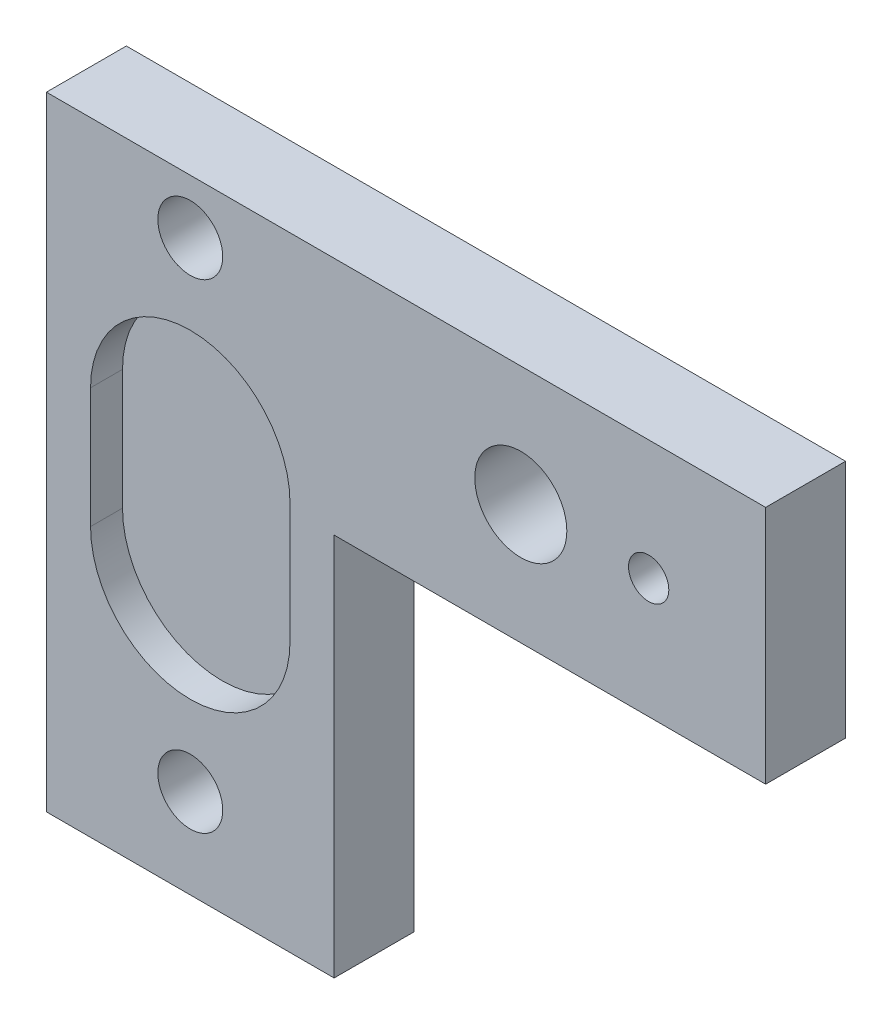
ISO-10303-21;
HEADER;
FILE_DESCRIPTION(('STEP AP214'),'2;1');
FILE_NAME('part.step','',(''),(''),'','','');
FILE_SCHEMA(('AUTOMOTIVE_DESIGN { 1 0 10303 214 1 1 1 1 }'));
ENDSEC;
DATA;
#1=APPLICATION_CONTEXT('core data for automotive mechanical design processes');
#2=APPLICATION_PROTOCOL_DEFINITION('international standard','automotive_design',2000,#1);
#3=PRODUCT_CONTEXT('',#1,'mechanical');
#4=PRODUCT('Part','Part','',(#3));
#5=PRODUCT_RELATED_PRODUCT_CATEGORY('part','',(#4));
#6=PRODUCT_DEFINITION_FORMATION('','',#4);
#7=PRODUCT_DEFINITION_CONTEXT('part definition',#1,'design');
#8=PRODUCT_DEFINITION('design','',#6,#7);
#9=PRODUCT_DEFINITION_SHAPE('','',#8);
#10=(LENGTH_UNIT() NAMED_UNIT(*) SI_UNIT(.MILLI.,.METRE.));
#11=(NAMED_UNIT(*) PLANE_ANGLE_UNIT() SI_UNIT($,.RADIAN.));
#12=(NAMED_UNIT(*) SI_UNIT($,.STERADIAN.) SOLID_ANGLE_UNIT());
#13=UNCERTAINTY_MEASURE_WITH_UNIT(LENGTH_MEASURE(1.E-05),#10,'distance_accuracy_value','');
#14=(GEOMETRIC_REPRESENTATION_CONTEXT(3) GLOBAL_UNCERTAINTY_ASSIGNED_CONTEXT((#13)) GLOBAL_UNIT_ASSIGNED_CONTEXT((#10,
#11,#12)) REPRESENTATION_CONTEXT('',''));
#15=CARTESIAN_POINT('',(0.,0.,0.));
#16=DIRECTION('',(0.,0.,1.));
#17=DIRECTION('',(1.,0.,0.));
#18=AXIS2_PLACEMENT_3D('',#15,#16,#17);
#19=CARTESIAN_POINT('',(0.,0.,3.17500000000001));
#20=DIRECTION('',(0.,0.,-1.));
#21=DIRECTION('',(-1.,0.,0.));
#22=AXIS2_PLACEMENT_3D('',#19,#20,#21);
#23=PLANE('',#22);
#24=DIRECTION('',(0.,-1.,0.));
#25=VECTOR('',#24,1.);
#26=CARTESIAN_POINT('',(1.75259999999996,-9.2964,3.175));
#27=LINE('',#26,#25);
#28=CARTESIAN_POINT('',(1.75259999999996,-9.2964,3.175));
#29=VERTEX_POINT('',#28);
#30=CARTESIAN_POINT('',(1.7526,-14.0716,3.17499999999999));
#31=VERTEX_POINT('',#30);
#32=EDGE_CURVE('E263',#29,#31,#27,.T.);
#33=ORIENTED_EDGE('',*,*,#32,.F.);
#34=CARTESIAN_POINT('',(5.71499999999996,-9.29639999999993,3.175));
#35=DIRECTION('',(0.,0.,1.));
#36=DIRECTION('',(1.,0.,0.));
#37=AXIS2_PLACEMENT_3D('',#34,#35,#36);
#38=CIRCLE('',#37,3.9624);
#39=CARTESIAN_POINT('',(9.67739999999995,-9.29639999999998,3.17499999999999));
#40=VERTEX_POINT('',#39);
#41=EDGE_CURVE('E61',#40,#29,#38,.T.);
#42=ORIENTED_EDGE('',*,*,#41,.F.);
#43=DIRECTION('',(0.,1.,0.));
#44=VECTOR('',#43,1.);
#45=CARTESIAN_POINT('',(9.67739999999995,-9.29639999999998,3.17499999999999));
#46=LINE('',#45,#44);
#47=CARTESIAN_POINT('',(9.6774,-14.0716,3.17499999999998));
#48=VERTEX_POINT('',#47);
#49=EDGE_CURVE('E236',#48,#40,#46,.T.);
#50=ORIENTED_EDGE('',*,*,#49,.F.);
#51=CARTESIAN_POINT('',(5.715,-14.0715999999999,3.175));
#52=DIRECTION('',(0.,0.,1.));
#53=DIRECTION('',(1.,0.,0.));
#54=AXIS2_PLACEMENT_3D('',#51,#52,#53);
#55=CIRCLE('',#54,3.9624);
#56=EDGE_CURVE('E264',#31,#48,#55,.T.);
#57=ORIENTED_EDGE('',*,*,#56,.F.);
#58=EDGE_LOOP('',(#33,#42,#50,#57));
#59=FACE_BOUND('',#58,.T.);
#60=CARTESIAN_POINT('',(18.8468,-4.7625,3.17499999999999));
#61=DIRECTION('',(0.,0.,1.));
#62=DIRECTION('',(1.,0.,0.));
#63=AXIS2_PLACEMENT_3D('',#60,#61,#62);
#64=CIRCLE('',#63,1.8288);
#65=CARTESIAN_POINT('',(20.6756,-4.7625,3.17499999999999));
#66=VERTEX_POINT('',#65);
#67=EDGE_CURVE('E205',#66,#66,#64,.T.);
#68=ORIENTED_EDGE('',*,*,#67,.F.);
#69=EDGE_LOOP('',(#68));
#70=FACE_BOUND('',#69,.T.);
#71=CARTESIAN_POINT('',(5.715,-2.15899999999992,3.175));
#72=DIRECTION('',(0.,0.,1.));
#73=DIRECTION('',(1.,0.,0.));
#74=AXIS2_PLACEMENT_3D('',#71,#72,#73);
#75=CIRCLE('',#74,1.28905);
#76=CARTESIAN_POINT('',(7.00405,-2.15899999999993,3.175));
#77=VERTEX_POINT('',#76);
#78=EDGE_CURVE('E190',#77,#77,#75,.T.);
#79=ORIENTED_EDGE('',*,*,#78,.F.);
#80=EDGE_LOOP('',(#79));
#81=FACE_BOUND('',#80,.T.);
#82=CARTESIAN_POINT('',(5.715,-21.2089999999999,3.17499999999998));
#83=DIRECTION('',(0.,0.,1.));
#84=DIRECTION('',(1.,0.,0.));
#85=AXIS2_PLACEMENT_3D('',#82,#83,#84);
#86=CIRCLE('',#85,1.28905);
#87=CARTESIAN_POINT('',(7.00405,-21.2089999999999,3.17499999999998));
#88=VERTEX_POINT('',#87);
#89=EDGE_CURVE('E186',#88,#88,#86,.T.);
#90=ORIENTED_EDGE('',*,*,#89,.F.);
#91=EDGE_LOOP('',(#90));
#92=FACE_BOUND('',#91,.T.);
#93=DIRECTION('',(0.,-1.,0.));
#94=VECTOR('',#93,1.);
#95=CARTESIAN_POINT('',(0.,-24.765,3.17499999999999));
#96=LINE('',#95,#94);
#97=CARTESIAN_POINT('',(0.,0.,3.17500000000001));
#98=VERTEX_POINT('',#97);
#99=CARTESIAN_POINT('',(0.,-24.765,3.17499999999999));
#100=VERTEX_POINT('',#99);
#101=EDGE_CURVE('E173',#98,#100,#96,.T.);
#102=ORIENTED_EDGE('',*,*,#101,.T.);
#103=DIRECTION('',(1.,0.,0.));
#104=VECTOR('',#103,1.);
#105=CARTESIAN_POINT('',(11.43,-24.765,3.17499999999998));
#106=LINE('',#105,#104);
#107=CARTESIAN_POINT('',(11.43,-24.765,3.17499999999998));
#108=VERTEX_POINT('',#107);
#109=EDGE_CURVE('E110',#100,#108,#106,.T.);
#110=ORIENTED_EDGE('',*,*,#109,.T.);
#111=DIRECTION('',(0.,1.,0.));
#112=VECTOR('',#111,1.);
#113=CARTESIAN_POINT('',(11.43,-9.52499999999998,3.17499999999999));
#114=LINE('',#113,#112);
#115=CARTESIAN_POINT('',(11.43,-9.52499999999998,3.17499999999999));
#116=VERTEX_POINT('',#115);
#117=EDGE_CURVE('E130',#108,#116,#114,.T.);
#118=ORIENTED_EDGE('',*,*,#117,.T.);
#119=DIRECTION('',(1.,0.,0.));
#120=VECTOR('',#119,1.);
#121=CARTESIAN_POINT('',(28.575,-9.52499999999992,3.17499999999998));
#122=LINE('',#121,#120);
#123=CARTESIAN_POINT('',(28.575,-9.52499999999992,3.17499999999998));
#124=VERTEX_POINT('',#123);
#125=EDGE_CURVE('E123',#116,#124,#122,.T.);
#126=ORIENTED_EDGE('',*,*,#125,.T.);
#127=DIRECTION('',(0.,1.,0.));
#128=VECTOR('',#127,1.);
#129=CARTESIAN_POINT('',(28.575,0.,3.17499999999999));
#130=LINE('',#129,#128);
#131=CARTESIAN_POINT('',(28.575,0.,3.17499999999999));
#132=VERTEX_POINT('',#131);
#133=EDGE_CURVE('E127',#124,#132,#130,.T.);
#134=ORIENTED_EDGE('',*,*,#133,.T.);
#135=DIRECTION('',(-1.,0.,0.));
#136=VECTOR('',#135,1.);
#137=CARTESIAN_POINT('',(0.,0.,3.17500000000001));
#138=LINE('',#137,#136);
#139=EDGE_CURVE('E70',#132,#98,#138,.T.);
#140=ORIENTED_EDGE('',*,*,#139,.T.);
#141=EDGE_LOOP('',(#102,#110,#118,#126,#134,#140));
#142=FACE_BOUND('',#141,.T.);
#143=CARTESIAN_POINT('',(23.9268,-4.7625,3.17499999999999));
#144=DIRECTION('',(0.,0.,1.));
#145=DIRECTION('',(1.,0.,0.));
#146=AXIS2_PLACEMENT_3D('',#143,#144,#145);
#147=CIRCLE('',#146,0.8001);
#148=CARTESIAN_POINT('',(24.7269,-4.7625,3.17499999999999));
#149=VERTEX_POINT('',#148);
#150=EDGE_CURVE('E160',#149,#149,#147,.T.);
#151=ORIENTED_EDGE('',*,*,#150,.F.);
#152=EDGE_LOOP('',(#151));
#153=FACE_BOUND('',#152,.T.);
#154=ADVANCED_FACE('F42',(#59,#70,#81,#92,#142,#153),#23,.F.);
#155=CARTESIAN_POINT('',(0.,0.,0.));
#156=DIRECTION('',(0.,0.,-1.));
#157=DIRECTION('',(-1.,0.,0.));
#158=AXIS2_PLACEMENT_3D('',#155,#156,#157);
#159=PLANE('',#158);
#160=CARTESIAN_POINT('',(18.8468,-4.7625,0.));
#161=DIRECTION('',(0.,0.,-1.));
#162=DIRECTION('',(-1.,0.,0.));
#163=AXIS2_PLACEMENT_3D('',#160,#161,#162);
#164=CIRCLE('',#163,1.8288);
#165=CARTESIAN_POINT('',(17.018,-4.7625,0.));
#166=VERTEX_POINT('',#165);
#167=EDGE_CURVE('E46',#166,#166,#164,.T.);
#168=ORIENTED_EDGE('',*,*,#167,.F.);
#169=EDGE_LOOP('',(#168));
#170=FACE_BOUND('',#169,.T.);
#171=CARTESIAN_POINT('',(5.715,-2.15899999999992,0.));
#172=DIRECTION('',(0.,0.,-1.));
#173=DIRECTION('',(-1.,0.,0.));
#174=AXIS2_PLACEMENT_3D('',#171,#172,#173);
#175=CIRCLE('',#174,1.28905);
#176=CARTESIAN_POINT('',(4.42595,-2.15899999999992,0.));
#177=VERTEX_POINT('',#176);
#178=EDGE_CURVE('E187',#177,#177,#175,.T.);
#179=ORIENTED_EDGE('',*,*,#178,.F.);
#180=EDGE_LOOP('',(#179));
#181=FACE_BOUND('',#180,.T.);
#182=CARTESIAN_POINT('',(5.715,-21.2089999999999,0.));
#183=DIRECTION('',(0.,0.,-1.));
#184=DIRECTION('',(-1.,0.,0.));
#185=AXIS2_PLACEMENT_3D('',#182,#183,#184);
#186=CIRCLE('',#185,1.28905);
#187=CARTESIAN_POINT('',(4.42595,-21.2089999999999,0.));
#188=VERTEX_POINT('',#187);
#189=EDGE_CURVE('E182',#188,#188,#186,.T.);
#190=ORIENTED_EDGE('',*,*,#189,.F.);
#191=EDGE_LOOP('',(#190));
#192=FACE_BOUND('',#191,.T.);
#193=DIRECTION('',(0.,-1.,0.));
#194=VECTOR('',#193,1.);
#195=CARTESIAN_POINT('',(0.,-24.765,0.));
#196=LINE('',#195,#194);
#197=CARTESIAN_POINT('',(0.,0.,0.));
#198=VERTEX_POINT('',#197);
#199=CARTESIAN_POINT('',(0.,-24.765,0.));
#200=VERTEX_POINT('',#199);
#201=EDGE_CURVE('E155',#198,#200,#196,.T.);
#202=ORIENTED_EDGE('',*,*,#201,.F.);
#203=DIRECTION('',(-1.,0.,0.));
#204=VECTOR('',#203,1.);
#205=CARTESIAN_POINT('',(0.,0.,0.));
#206=LINE('',#205,#204);
#207=CARTESIAN_POINT('',(28.575,0.,0.));
#208=VERTEX_POINT('',#207);
#209=EDGE_CURVE('E102',#208,#198,#206,.T.);
#210=ORIENTED_EDGE('',*,*,#209,.F.);
#211=DIRECTION('',(0.,1.,0.));
#212=VECTOR('',#211,1.);
#213=CARTESIAN_POINT('',(28.575,0.,0.));
#214=LINE('',#213,#212);
#215=CARTESIAN_POINT('',(28.575,-9.52499999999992,0.));
#216=VERTEX_POINT('',#215);
#217=EDGE_CURVE('E168',#216,#208,#214,.T.);
#218=ORIENTED_EDGE('',*,*,#217,.F.);
#219=DIRECTION('',(1.,0.,0.));
#220=VECTOR('',#219,1.);
#221=CARTESIAN_POINT('',(28.575,-9.52499999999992,0.));
#222=LINE('',#221,#220);
#223=CARTESIAN_POINT('',(11.43,-9.52499999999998,0.));
#224=VERTEX_POINT('',#223);
#225=EDGE_CURVE('E140',#224,#216,#222,.T.);
#226=ORIENTED_EDGE('',*,*,#225,.F.);
#227=DIRECTION('',(0.,1.,0.));
#228=VECTOR('',#227,1.);
#229=CARTESIAN_POINT('',(11.43,-9.52499999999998,0.));
#230=LINE('',#229,#228);
#231=CARTESIAN_POINT('',(11.43,-24.765,0.));
#232=VERTEX_POINT('',#231);
#233=EDGE_CURVE('E163',#232,#224,#230,.T.);
#234=ORIENTED_EDGE('',*,*,#233,.F.);
#235=DIRECTION('',(1.,0.,0.));
#236=VECTOR('',#235,1.);
#237=CARTESIAN_POINT('',(11.43,-24.765,0.));
#238=LINE('',#237,#236);
#239=EDGE_CURVE('E159',#200,#232,#238,.T.);
#240=ORIENTED_EDGE('',*,*,#239,.F.);
#241=EDGE_LOOP('',(#202,#210,#218,#226,#234,#240));
#242=FACE_BOUND('',#241,.T.);
#243=CARTESIAN_POINT('',(23.9268,-4.7625,0.));
#244=DIRECTION('',(0.,0.,1.));
#245=DIRECTION('',(1.,0.,0.));
#246=AXIS2_PLACEMENT_3D('',#243,#244,#245);
#247=CIRCLE('',#246,0.8001);
#248=CARTESIAN_POINT('',(24.7269,-4.7625,0.));
#249=VERTEX_POINT('',#248);
#250=EDGE_CURVE('E185',#249,#249,#247,.T.);
#251=ORIENTED_EDGE('',*,*,#250,.T.);
#252=EDGE_LOOP('',(#251));
#253=FACE_BOUND('',#252,.T.);
#254=ADVANCED_FACE('F301',(#170,#181,#192,#242,#253),#159,.T.);
#255=CARTESIAN_POINT('',(0.,-24.765,3.17499999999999));
#256=DIRECTION('',(1.,0.,0.));
#257=DIRECTION('',(0.,0.,-1.));
#258=AXIS2_PLACEMENT_3D('',#255,#256,#257);
#259=PLANE('',#258);
#260=ORIENTED_EDGE('',*,*,#201,.T.);
#261=DIRECTION('',(0.,0.,-1.));
#262=VECTOR('',#261,1.);
#263=CARTESIAN_POINT('',(0.,-24.765,3.17499999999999));
#264=LINE('',#263,#262);
#265=EDGE_CURVE('E11',#100,#200,#264,.T.);
#266=ORIENTED_EDGE('',*,*,#265,.F.);
#267=ORIENTED_EDGE('',*,*,#101,.F.);
#268=DIRECTION('',(0.,0.,-1.));
#269=VECTOR('',#268,1.);
#270=CARTESIAN_POINT('',(0.,0.,3.17500000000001));
#271=LINE('',#270,#269);
#272=EDGE_CURVE('E151',#98,#198,#271,.T.);
#273=ORIENTED_EDGE('',*,*,#272,.T.);
#274=EDGE_LOOP('',(#260,#266,#267,#273));
#275=FACE_BOUND('',#274,.T.);
#276=ADVANCED_FACE('F44',(#275),#259,.F.);
#277=CARTESIAN_POINT('',(11.43,-24.765,3.17499999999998));
#278=DIRECTION('',(0.,1.,0.));
#279=DIRECTION('',(0.,0.,1.));
#280=AXIS2_PLACEMENT_3D('',#277,#278,#279);
#281=PLANE('',#280);
#282=ORIENTED_EDGE('',*,*,#239,.T.);
#283=DIRECTION('',(0.,0.,-1.));
#284=VECTOR('',#283,1.);
#285=CARTESIAN_POINT('',(11.43,-24.765,3.17499999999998));
#286=LINE('',#285,#284);
#287=EDGE_CURVE('E51',#108,#232,#286,.T.);
#288=ORIENTED_EDGE('',*,*,#287,.F.);
#289=ORIENTED_EDGE('',*,*,#109,.F.);
#290=ORIENTED_EDGE('',*,*,#265,.T.);
#291=EDGE_LOOP('',(#282,#288,#289,#290));
#292=FACE_BOUND('',#291,.T.);
#293=ADVANCED_FACE('F335',(#292),#281,.F.);
#294=CARTESIAN_POINT('',(11.43,-9.52499999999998,3.17499999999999));
#295=DIRECTION('',(-1.,0.,0.));
#296=DIRECTION('',(0.,0.,1.));
#297=AXIS2_PLACEMENT_3D('',#294,#295,#296);
#298=PLANE('',#297);
#299=ORIENTED_EDGE('',*,*,#233,.T.);
#300=DIRECTION('',(0.,0.,-1.));
#301=VECTOR('',#300,1.);
#302=CARTESIAN_POINT('',(11.43,-9.52499999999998,3.17499999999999));
#303=LINE('',#302,#301);
#304=EDGE_CURVE('E144',#116,#224,#303,.T.);
#305=ORIENTED_EDGE('',*,*,#304,.F.);
#306=ORIENTED_EDGE('',*,*,#117,.F.);
#307=ORIENTED_EDGE('',*,*,#287,.T.);
#308=EDGE_LOOP('',(#299,#305,#306,#307));
#309=FACE_BOUND('',#308,.T.);
#310=ADVANCED_FACE('F333',(#309),#298,.F.);
#311=CARTESIAN_POINT('',(28.575,-9.52499999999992,3.17499999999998));
#312=DIRECTION('',(0.,1.,0.));
#313=DIRECTION('',(-1.,0.,0.));
#314=AXIS2_PLACEMENT_3D('',#311,#312,#313);
#315=PLANE('',#314);
#316=ORIENTED_EDGE('',*,*,#225,.T.);
#317=DIRECTION('',(0.,0.,-1.));
#318=VECTOR('',#317,1.);
#319=CARTESIAN_POINT('',(28.575,-9.52499999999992,3.17499999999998));
#320=LINE('',#319,#318);
#321=EDGE_CURVE('E137',#124,#216,#320,.T.);
#322=ORIENTED_EDGE('',*,*,#321,.F.);
#323=ORIENTED_EDGE('',*,*,#125,.F.);
#324=ORIENTED_EDGE('',*,*,#304,.T.);
#325=EDGE_LOOP('',(#316,#322,#323,#324));
#326=FACE_BOUND('',#325,.T.);
#327=ADVANCED_FACE('F138',(#326),#315,.F.);
#328=CARTESIAN_POINT('',(28.575,0.,3.17499999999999));
#329=DIRECTION('',(-1.,0.,0.));
#330=DIRECTION('',(0.,0.,1.));
#331=AXIS2_PLACEMENT_3D('',#328,#329,#330);
#332=PLANE('',#331);
#333=ORIENTED_EDGE('',*,*,#217,.T.);
#334=DIRECTION('',(0.,0.,-1.));
#335=VECTOR('',#334,1.);
#336=CARTESIAN_POINT('',(28.575,0.,3.17499999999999));
#337=LINE('',#336,#335);
#338=EDGE_CURVE('E145',#132,#208,#337,.T.);
#339=ORIENTED_EDGE('',*,*,#338,.F.);
#340=ORIENTED_EDGE('',*,*,#133,.F.);
#341=ORIENTED_EDGE('',*,*,#321,.T.);
#342=EDGE_LOOP('',(#333,#339,#340,#341));
#343=FACE_BOUND('',#342,.T.);
#344=ADVANCED_FACE('F147',(#343),#332,.F.);
#345=CARTESIAN_POINT('',(0.,0.,3.17500000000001));
#346=DIRECTION('',(0.,-1.,0.));
#347=DIRECTION('',(0.,0.,-1.));
#348=AXIS2_PLACEMENT_3D('',#345,#346,#347);
#349=PLANE('',#348);
#350=ORIENTED_EDGE('',*,*,#209,.T.);
#351=ORIENTED_EDGE('',*,*,#272,.F.);
#352=ORIENTED_EDGE('',*,*,#139,.F.);
#353=ORIENTED_EDGE('',*,*,#338,.T.);
#354=EDGE_LOOP('',(#350,#351,#352,#353));
#355=FACE_BOUND('',#354,.T.);
#356=ADVANCED_FACE('F319',(#355),#349,.F.);
#357=CARTESIAN_POINT('',(23.9268,-4.7625,3.17499999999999));
#358=DIRECTION('',(0.,0.,-1.));
#359=DIRECTION('',(-1.,0.,0.));
#360=AXIS2_PLACEMENT_3D('',#357,#358,#359);
#361=CYLINDRICAL_SURFACE('',#360,0.8001);
#362=ORIENTED_EDGE('',*,*,#150,.T.);
#363=EDGE_LOOP('',(#362));
#364=FACE_BOUND('',#363,.T.);
#365=ORIENTED_EDGE('',*,*,#250,.F.);
#366=EDGE_LOOP('',(#365));
#367=FACE_BOUND('',#366,.T.);
#368=ADVANCED_FACE('F310',(#364,#367),#361,.F.);
#369=CARTESIAN_POINT('',(5.715,-21.2089999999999,3.17499999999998));
#370=DIRECTION('',(0.,0.,1.));
#371=DIRECTION('',(1.,0.,0.));
#372=AXIS2_PLACEMENT_3D('',#369,#370,#371);
#373=CYLINDRICAL_SURFACE('',#372,1.28905);
#374=ORIENTED_EDGE('',*,*,#189,.T.);
#375=EDGE_LOOP('',(#374));
#376=FACE_BOUND('',#375,.T.);
#377=ORIENTED_EDGE('',*,*,#89,.T.);
#378=EDGE_LOOP('',(#377));
#379=FACE_BOUND('',#378,.T.);
#380=ADVANCED_FACE('F307',(#376,#379),#373,.F.);
#381=CARTESIAN_POINT('',(5.715,-2.15899999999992,3.175));
#382=DIRECTION('',(0.,0.,1.));
#383=DIRECTION('',(1.,0.,0.));
#384=AXIS2_PLACEMENT_3D('',#381,#382,#383);
#385=CYLINDRICAL_SURFACE('',#384,1.28905);
#386=ORIENTED_EDGE('',*,*,#178,.T.);
#387=EDGE_LOOP('',(#386));
#388=FACE_BOUND('',#387,.T.);
#389=ORIENTED_EDGE('',*,*,#78,.T.);
#390=EDGE_LOOP('',(#389));
#391=FACE_BOUND('',#390,.T.);
#392=ADVANCED_FACE('F309',(#388,#391),#385,.F.);
#393=CARTESIAN_POINT('',(18.8468,-4.7625,3.17499999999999));
#394=DIRECTION('',(0.,0.,1.));
#395=DIRECTION('',(1.,0.,0.));
#396=AXIS2_PLACEMENT_3D('',#393,#394,#395);
#397=CYLINDRICAL_SURFACE('',#396,1.8288);
#398=ORIENTED_EDGE('',*,*,#167,.T.);
#399=EDGE_LOOP('',(#398));
#400=FACE_BOUND('',#399,.T.);
#401=ORIENTED_EDGE('',*,*,#67,.T.);
#402=EDGE_LOOP('',(#401));
#403=FACE_BOUND('',#402,.T.);
#404=ADVANCED_FACE('F317',(#400,#403),#397,.F.);
#405=CARTESIAN_POINT('',(5.71499999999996,-9.29639999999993,1.905));
#406=DIRECTION('',(0.,0.,1.));
#407=DIRECTION('',(1.,0.,0.));
#408=AXIS2_PLACEMENT_3D('',#405,#406,#407);
#409=CYLINDRICAL_SURFACE('',#408,3.9624);
#410=ORIENTED_EDGE('',*,*,#41,.T.);
#411=DIRECTION('',(0.,0.,1.));
#412=VECTOR('',#411,1.);
#413=CARTESIAN_POINT('',(1.75259999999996,-9.2964,1.905));
#414=LINE('',#413,#412);
#415=CARTESIAN_POINT('',(1.75259999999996,-9.2964,1.905));
#416=VERTEX_POINT('',#415);
#417=EDGE_CURVE('E241',#416,#29,#414,.T.);
#418=ORIENTED_EDGE('',*,*,#417,.F.);
#419=CARTESIAN_POINT('',(5.71499999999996,-9.29639999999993,1.905));
#420=DIRECTION('',(0.,0.,1.));
#421=DIRECTION('',(1.,0.,0.));
#422=AXIS2_PLACEMENT_3D('',#419,#420,#421);
#423=CIRCLE('',#422,3.9624);
#424=CARTESIAN_POINT('',(9.67739999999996,-9.29639999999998,1.90499999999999));
#425=VERTEX_POINT('',#424);
#426=EDGE_CURVE('E272',#425,#416,#423,.T.);
#427=ORIENTED_EDGE('',*,*,#426,.F.);
#428=DIRECTION('',(0.,0.,1.));
#429=VECTOR('',#428,1.);
#430=CARTESIAN_POINT('',(9.67739999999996,-9.29639999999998,1.90499999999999));
#431=LINE('',#430,#429);
#432=EDGE_CURVE('E222',#425,#40,#431,.T.);
#433=ORIENTED_EDGE('',*,*,#432,.T.);
#434=EDGE_LOOP('',(#410,#418,#427,#433));
#435=FACE_BOUND('',#434,.T.);
#436=ADVANCED_FACE('F415',(#435),#409,.F.);
#437=CARTESIAN_POINT('',(9.67739999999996,-9.29639999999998,1.90499999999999));
#438=DIRECTION('',(1.,0.,0.));
#439=DIRECTION('',(0.,0.,-1.));
#440=AXIS2_PLACEMENT_3D('',#437,#438,#439);
#441=PLANE('',#440);
#442=ORIENTED_EDGE('',*,*,#49,.T.);
#443=ORIENTED_EDGE('',*,*,#432,.F.);
#444=DIRECTION('',(0.,1.,0.));
#445=VECTOR('',#444,1.);
#446=CARTESIAN_POINT('',(9.67739999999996,-9.29639999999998,1.90499999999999));
#447=LINE('',#446,#445);
#448=CARTESIAN_POINT('',(9.6774,-14.0716,1.90499999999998));
#449=VERTEX_POINT('',#448);
#450=EDGE_CURVE('E243',#449,#425,#447,.T.);
#451=ORIENTED_EDGE('',*,*,#450,.F.);
#452=DIRECTION('',(0.,0.,1.));
#453=VECTOR('',#452,1.);
#454=CARTESIAN_POINT('',(9.6774,-14.0716,1.90499999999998));
#455=LINE('',#454,#453);
#456=EDGE_CURVE('E226',#449,#48,#455,.T.);
#457=ORIENTED_EDGE('',*,*,#456,.T.);
#458=EDGE_LOOP('',(#442,#443,#451,#457));
#459=FACE_BOUND('',#458,.T.);
#460=ADVANCED_FACE('F296',(#459),#441,.F.);
#461=CARTESIAN_POINT('',(5.715,-14.0715999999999,1.90499999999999));
#462=DIRECTION('',(0.,0.,1.));
#463=DIRECTION('',(1.,0.,0.));
#464=AXIS2_PLACEMENT_3D('',#461,#462,#463);
#465=CYLINDRICAL_SURFACE('',#464,3.9624);
#466=ORIENTED_EDGE('',*,*,#56,.T.);
#467=ORIENTED_EDGE('',*,*,#456,.F.);
#468=CARTESIAN_POINT('',(5.715,-14.0715999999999,1.90499999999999));
#469=DIRECTION('',(0.,0.,1.));
#470=DIRECTION('',(1.,0.,0.));
#471=AXIS2_PLACEMENT_3D('',#468,#469,#470);
#472=CIRCLE('',#471,3.9624);
#473=CARTESIAN_POINT('',(1.7526,-14.0716,1.90499999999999));
#474=VERTEX_POINT('',#473);
#475=EDGE_CURVE('E251',#474,#449,#472,.T.);
#476=ORIENTED_EDGE('',*,*,#475,.F.);
#477=DIRECTION('',(0.,0.,1.));
#478=VECTOR('',#477,1.);
#479=CARTESIAN_POINT('',(1.7526,-14.0716,1.90499999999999));
#480=LINE('',#479,#478);
#481=EDGE_CURVE('E233',#474,#31,#480,.T.);
#482=ORIENTED_EDGE('',*,*,#481,.T.);
#483=EDGE_LOOP('',(#466,#467,#476,#482));
#484=FACE_BOUND('',#483,.T.);
#485=ADVANCED_FACE('F297',(#484),#465,.F.);
#486=CARTESIAN_POINT('',(1.75259999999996,-9.2964,1.905));
#487=DIRECTION('',(-1.,0.,0.));
#488=DIRECTION('',(0.,-1.,0.));
#489=AXIS2_PLACEMENT_3D('',#486,#487,#488);
#490=PLANE('',#489);
#491=ORIENTED_EDGE('',*,*,#32,.T.);
#492=ORIENTED_EDGE('',*,*,#481,.F.);
#493=DIRECTION('',(0.,-1.,0.));
#494=VECTOR('',#493,1.);
#495=CARTESIAN_POINT('',(1.75259999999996,-9.2964,1.905));
#496=LINE('',#495,#494);
#497=EDGE_CURVE('E258',#416,#474,#496,.T.);
#498=ORIENTED_EDGE('',*,*,#497,.F.);
#499=ORIENTED_EDGE('',*,*,#417,.T.);
#500=EDGE_LOOP('',(#491,#492,#498,#499));
#501=FACE_BOUND('',#500,.T.);
#502=ADVANCED_FACE('F285',(#501),#490,.F.);
#503=CARTESIAN_POINT('',(5.71499999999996,-9.29639999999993,1.905));
#504=DIRECTION('',(0.,0.,1.));
#505=DIRECTION('',(1.,0.,0.));
#506=AXIS2_PLACEMENT_3D('',#503,#504,#505);
#507=PLANE('',#506);
#508=ORIENTED_EDGE('',*,*,#426,.T.);
#509=ORIENTED_EDGE('',*,*,#497,.T.);
#510=ORIENTED_EDGE('',*,*,#475,.T.);
#511=ORIENTED_EDGE('',*,*,#450,.T.);
#512=EDGE_LOOP('',(#508,#509,#510,#511));
#513=FACE_BOUND('',#512,.T.);
#514=ADVANCED_FACE('F279',(#513),#507,.T.);
#515=CLOSED_SHELL('',(#154,#254,#276,#293,#310,#327,#344,#356,#368,#380,#392,#404,#436,#460,
#485,#502,#514));
#516=MANIFOLD_SOLID_BREP('B2',#515);
#517=ADVANCED_BREP_SHAPE_REPRESENTATION('',(#18,#516),#14);
#518=SHAPE_DEFINITION_REPRESENTATION(#9,#517);
ENDSEC;
END-ISO-10303-21;
